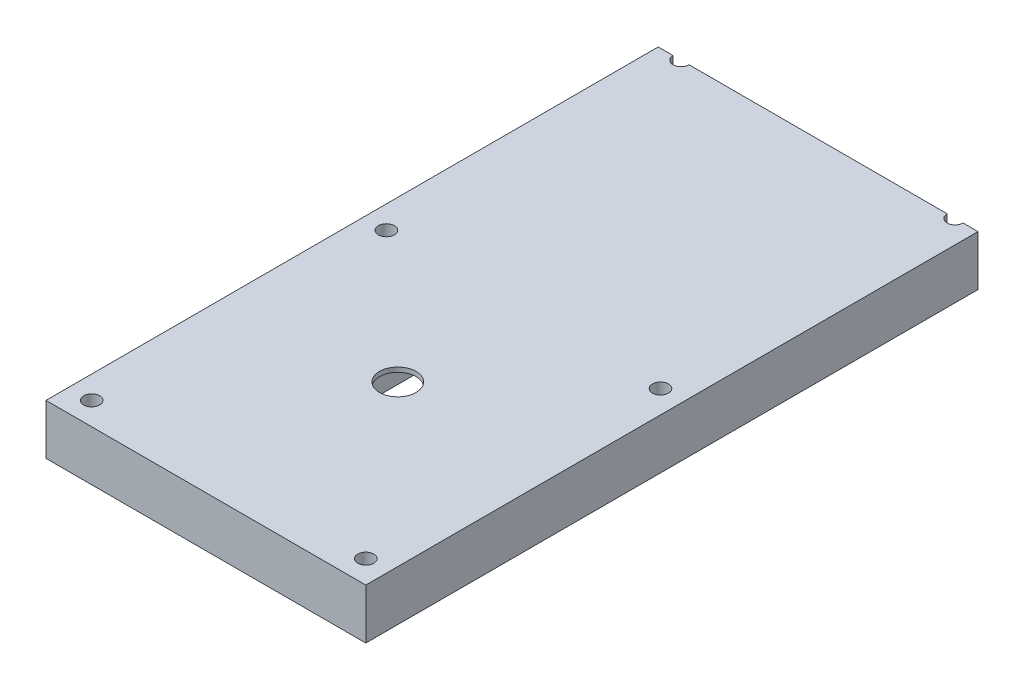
from build123d import *

# Parameters (mm, degrees)
SKETCH_1_W          = 70
SKETCH_1_H          = 134
EXTRUDE_1_DEPTH     = 11
SKETCH_3_R          = 4
CUT_EXTRUDE_1_DEPTH = 10
SKETCH_4_R          = 1.75
CUT_EXTRUDE_2_DEPTH = 77.387171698
SKETCH_6_W          = 20.5
SKETCH_6_H          = 4
EXTRUDE_3_DEPTH     = 12.75
SKETCH_7_W          = 21
SKETCH_7_H          = 98
CUT_EXTRUDE_3_DEPTH = 10


with BuildPart() as part:
    # Sketch 1 → Extrude 1 (new body)
    with BuildSketch(Plane(origin=(0, 0, 0), x_dir=(1, 0, 0), z_dir=(0, 1, 0))):
        Rectangle(SKETCH_1_W, SKETCH_1_H)
    extrude(amount=EXTRUDE_1_DEPTH)

    # Sketch 3 → Cut-Extrude 1 (cut)
    with BuildSketch(Plane(origin=(0, 11, 0), x_dir=(1, 0, 0), z_dir=(0, 1, 0))):
        with Locations(Location((0, -25, 0), (0, 0, 270))):
            Circle(SKETCH_3_R)
    extrude(amount=-CUT_EXTRUDE_1_DEPTH, mode=Mode.SUBTRACT)

    # Sketch 4 → Cut-Extrude 2 (cut, through all)
    with BuildSketch(Plane(origin=(0, 11, 0), x_dir=(1, 0, 0), z_dir=(0, 1, 0))):
        with Locations((-30, 67)):
            Circle(SKETCH_4_R)
        with Locations((30, 67)):
            Circle(SKETCH_4_R)
        with Locations(Location((-30, 2.5, 0), (0, 0, 270))):
            Circle(SKETCH_4_R)
        with Locations(Location((30, 2.5, 0), (0, 0, 270))):
            Circle(SKETCH_4_R)
        with Locations(Location((30, -62, 0), (0, 0, 270))):
            Circle(SKETCH_4_R)
        with Locations(Location((-30, -62, 0), (0, 0, 270))):
            Circle(SKETCH_4_R)
    extrude(amount=-CUT_EXTRUDE_2_DEPTH, mode=Mode.SUBTRACT)

    # Sketch 6 → Extrude 3 (add)
    with BuildSketch(Plane.XZ):
        with Locations((0, -65)):
            Rectangle(SKETCH_6_W, SKETCH_6_H)
    extrude(amount=EXTRUDE_3_DEPTH)

    # Sketch 7 → Cut-Extrude 3 (cut)
    with BuildSketch(Plane.XZ):
        with Locations((0, -14)):
            Rectangle(SKETCH_7_W, SKETCH_7_H)
    extrude(amount=-CUT_EXTRUDE_3_DEPTH, mode=Mode.SUBTRACT)


solid = part.part
